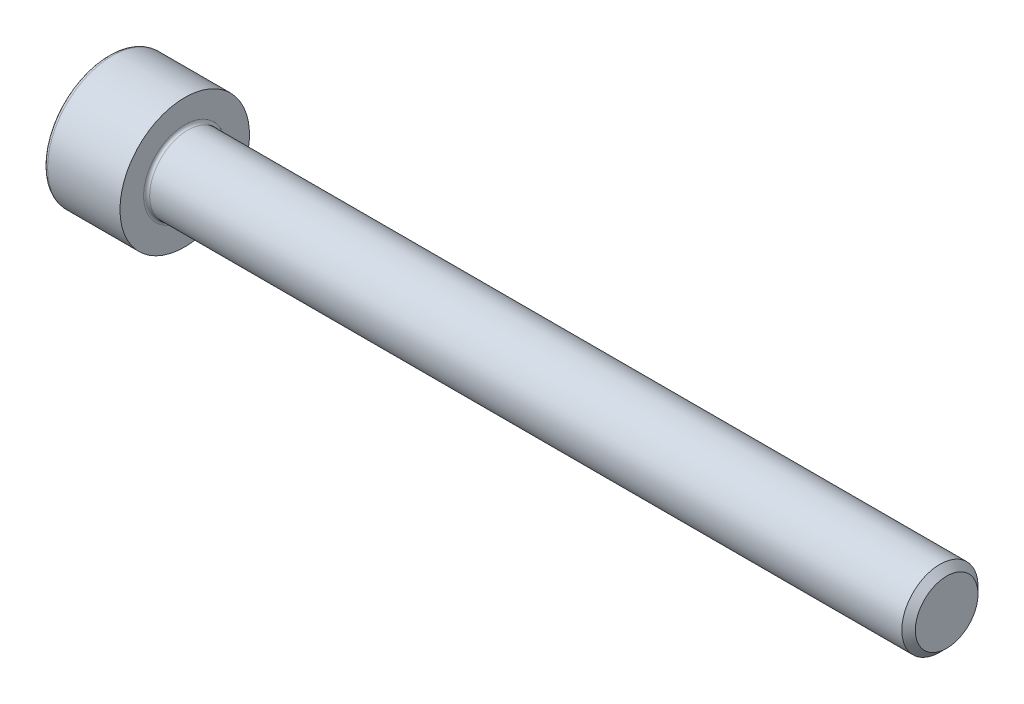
from build123d import *

# Parameters (mm, degrees)
FILLET1_R   = 0.2
FILLET2_R   = 0.25
HEX_2_DEPTH = 2.5


with BuildPart() as part:
    # BodySke → Base-Revolve (revolve)
    with BuildSketch(Plane.XY, mode=Mode.PRIVATE) as base_revolve_sk:
        Polygon((0, 0), (0, 4.25), (5, 4.25), (5, 2.5), (54.555, 2.5), (55, 2.055), (55, 0), align=None)
    revolve(base_revolve_sk.sketch.rotate(Axis((-31.75, 0, 0), (1, 0, 0)), 90), axis=Axis((-31.75, 0, 0), (1, 0, 0)))

    # Fillet1
    fillet1_edges = [part.edges().sort_by_distance(p)[0] for p in [
        (5, 0, -2.5),
    ]]
    fillet(fillet1_edges, radius=FILLET1_R)

    # Fillet2
    fillet2_edges = [part.edges().sort_by_distance(p)[0] for p in [
        (0, 0, -4.25),
    ]]
    fillet(fillet2_edges, radius=FILLET2_R)

    # Sketch2 → Hex-PreBroach (revolve, cut)
    with BuildSketch(Plane.XY, mode=Mode.PRIVATE) as hex_prebroach_sk:
        Polygon((0, 2.042), (2.5, 2.042), (3.67894925, 0), (0, 0), align=None)
    revolve(hex_prebroach_sk.sketch.rotate(Axis((0, 0, 0), (1, 0, 0)), 90), axis=Axis((0, 0, 0), (1, 0, 0)), mode=Mode.SUBTRACT)

    # Sketch3 → Hex 2 (cut)
    with BuildSketch(Plane(origin=(0, 0, 0), x_dir=(0, 0.500000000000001, 0.866025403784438), z_dir=(-1, 0, 0))):
        Polygon((1.17894925, 2.042), (-1.17894925, 2.042), (-2.357898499, 0), (-1.17894925, -2.042), (1.17894925, -2.042), (2.357898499, 0), align=None)
    extrude(amount=-HEX_2_DEPTH, mode=Mode.SUBTRACT)


solid = part.part
